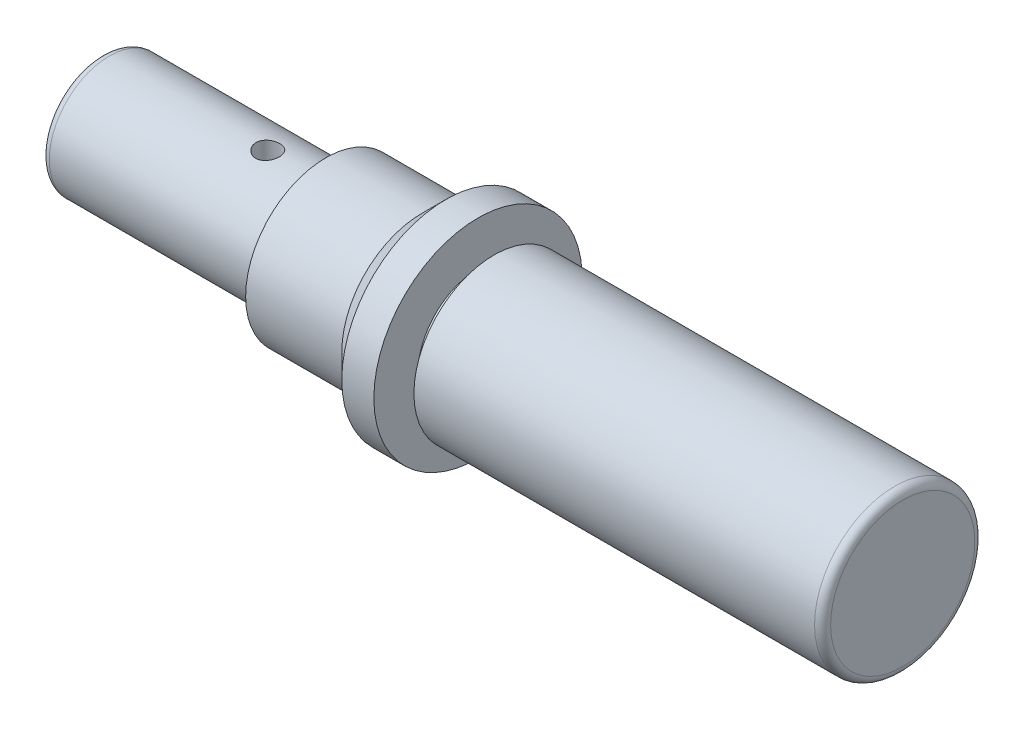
from build123d import *

# Parameters (mm, degrees)
FILLET1_R             = 1
F_1_0MM_DOWEL_HOLE1_D = 3


with BuildPart() as part:
    # Sketch1 → Revolve1 (revolve)
    with BuildSketch(Plane.XY, mode=Mode.PRIVATE) as revolve1_sk:
        Polygon((-61.69976402, 9.89779966), (-61.69976402, 17.39779966), (-33.69976402, 17.39779966), (-33.69976402, 19.89779966), (-21.69976402, 19.89779966), (-18.69976402, 22.89779966), (-14.69976402, 22.89779966), (-14.69976402, 17.39779966), (-12.69976402, 17.39779966), (-12.69976402, 19.89779966), (38.30023598, 19.89779966), (38.30023598, 9.89779966), align=None)
    revolve(revolve1_sk.sketch.rotate(Axis((-61.69976402, 9.89779966, 0), (1, 0, 0)), 90), axis=Axis((-61.69976402, 9.89779966, 0), (1, 0, 0)))

    # Fillet1
    fillet1_edges = [part.edges().sort_by_distance(p)[0] for p in [
        (-61.69976402, 9.89779966, -7.5),
        (38.30023598, 9.89779966, -10),
    ]]
    fillet(fillet1_edges, radius=FILLET1_R)

    # 1.0mm Dowel Hole1 (through all)
    with Locations(Plane(origin=(-40.69976402, 17.394100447, 0.235530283), x_dir=(0, -0.031404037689, 0.999506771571), z_dir=(0, 0.999506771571, 0.031404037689))):
        with Locations((0, 0)):
            Hole(F_1_0MM_DOWEL_HOLE1_D / 2)


solid = part.part
